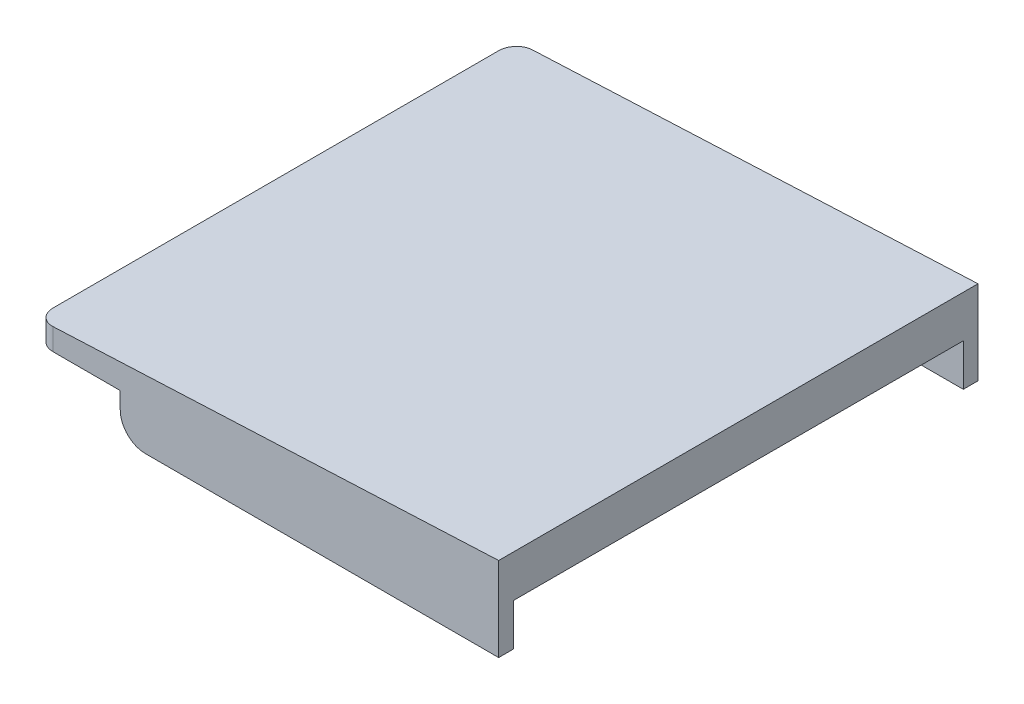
ISO-10303-21;
HEADER;
FILE_DESCRIPTION(('STEP AP214'),'2;1');
FILE_NAME('part.step','',(''),(''),'','','');
FILE_SCHEMA(('AUTOMOTIVE_DESIGN { 1 0 10303 214 1 1 1 1 }'));
ENDSEC;
DATA;
#1=APPLICATION_CONTEXT('core data for automotive mechanical design processes');
#2=APPLICATION_PROTOCOL_DEFINITION('international standard','automotive_design',2000,#1);
#3=PRODUCT_CONTEXT('',#1,'mechanical');
#4=PRODUCT('Part','Part','',(#3));
#5=PRODUCT_RELATED_PRODUCT_CATEGORY('part','',(#4));
#6=PRODUCT_DEFINITION_FORMATION('','',#4);
#7=PRODUCT_DEFINITION_CONTEXT('part definition',#1,'design');
#8=PRODUCT_DEFINITION('design','',#6,#7);
#9=PRODUCT_DEFINITION_SHAPE('','',#8);
#10=(LENGTH_UNIT() NAMED_UNIT(*) SI_UNIT(.MILLI.,.METRE.));
#11=(NAMED_UNIT(*) PLANE_ANGLE_UNIT() SI_UNIT($,.RADIAN.));
#12=(NAMED_UNIT(*) SI_UNIT($,.STERADIAN.) SOLID_ANGLE_UNIT());
#13=UNCERTAINTY_MEASURE_WITH_UNIT(LENGTH_MEASURE(1.E-05),#10,'distance_accuracy_value','');
#14=(GEOMETRIC_REPRESENTATION_CONTEXT(3) GLOBAL_UNCERTAINTY_ASSIGNED_CONTEXT((#13)) GLOBAL_UNIT_ASSIGNED_CONTEXT((#10,
#11,#12)) REPRESENTATION_CONTEXT('',''));
#15=CARTESIAN_POINT('',(0.,0.,0.));
#16=DIRECTION('',(0.,0.,1.));
#17=DIRECTION('',(1.,0.,0.));
#18=AXIS2_PLACEMENT_3D('',#15,#16,#17);
#19=CARTESIAN_POINT('',(0.,0.,57.));
#20=DIRECTION('',(0.,1.,0.));
#21=DIRECTION('',(0.,0.,1.));
#22=AXIS2_PLACEMENT_3D('',#19,#20,#21);
#23=PLANE('',#22);
#24=DIRECTION('',(1.,0.,0.));
#25=VECTOR('',#24,1.);
#26=CARTESIAN_POINT('',(0.,0.,2.));
#27=LINE('',#26,#25);
#28=CARTESIAN_POINT('',(2.,0.,2.));
#29=VERTEX_POINT('',#28);
#30=CARTESIAN_POINT('',(53.,0.,2.));
#31=VERTEX_POINT('',#30);
#32=EDGE_CURVE('E300',#29,#31,#27,.T.);
#33=ORIENTED_EDGE('',*,*,#32,.F.);
#34=DIRECTION('',(0.,0.,-1.));
#35=VECTOR('',#34,1.);
#36=CARTESIAN_POINT('',(2.,0.,57.));
#37=LINE('',#36,#35);
#38=CARTESIAN_POINT('',(2.,0.,55.));
#39=VERTEX_POINT('',#38);
#40=EDGE_CURVE('E216',#39,#29,#37,.T.);
#41=ORIENTED_EDGE('',*,*,#40,.F.);
#42=DIRECTION('',(1.,0.,0.));
#43=VECTOR('',#42,1.);
#44=CARTESIAN_POINT('',(0.,0.,55.));
#45=LINE('',#44,#43);
#46=CARTESIAN_POINT('',(53.,0.,55.));
#47=VERTEX_POINT('',#46);
#48=EDGE_CURVE('E221',#39,#47,#45,.T.);
#49=ORIENTED_EDGE('',*,*,#48,.T.);
#50=DIRECTION('',(0.,0.,-1.));
#51=VECTOR('',#50,1.);
#52=CARTESIAN_POINT('',(53.,0.,57.));
#53=LINE('',#52,#51);
#54=EDGE_CURVE('E321',#47,#31,#53,.T.);
#55=ORIENTED_EDGE('',*,*,#54,.T.);
#56=EDGE_LOOP('',(#33,#41,#49,#55));
#57=FACE_BOUND('',#56,.T.);
#58=DIRECTION('',(1.,0.,0.));
#59=VECTOR('',#58,1.);
#60=CARTESIAN_POINT('',(9.99999999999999,0.,55.25));
#61=LINE('',#60,#59);
#62=CARTESIAN_POINT('',(9.99999999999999,0.,55.25));
#63=VERTEX_POINT('',#62);
#64=CARTESIAN_POINT('',(55.,0.,55.25));
#65=VERTEX_POINT('',#64);
#66=EDGE_CURVE('E164',#63,#65,#61,.T.);
#67=ORIENTED_EDGE('',*,*,#66,.F.);
#68=DIRECTION('',(0.,0.,-1.));
#69=VECTOR('',#68,1.);
#70=CARTESIAN_POINT('',(9.99999999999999,0.,55.25));
#71=LINE('',#70,#69);
#72=CARTESIAN_POINT('',(9.99999999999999,0.,57.));
#73=VERTEX_POINT('',#72);
#74=EDGE_CURVE('E170',#73,#63,#71,.T.);
#75=ORIENTED_EDGE('',*,*,#74,.F.);
#76=DIRECTION('',(1.,0.,0.));
#77=VECTOR('',#76,1.);
#78=CARTESIAN_POINT('',(0.,0.,57.));
#79=LINE('',#78,#77);
#80=CARTESIAN_POINT('',(2.,0.,57.));
#81=VERTEX_POINT('',#80);
#82=EDGE_CURVE('E227',#81,#73,#79,.T.);
#83=ORIENTED_EDGE('',*,*,#82,.F.);
#84=CARTESIAN_POINT('',(2.,0.,55.));
#85=DIRECTION('',(0.,1.,0.));
#86=DIRECTION('',(0.,0.,1.));
#87=AXIS2_PLACEMENT_3D('',#84,#85,#86);
#88=CIRCLE('',#87,2.);
#89=CARTESIAN_POINT('',(0.,0.,55.));
#90=VERTEX_POINT('',#89);
#91=EDGE_CURVE('E198',#81,#90,#88,.F.);
#92=ORIENTED_EDGE('',*,*,#91,.T.);
#93=DIRECTION('',(0.,0.,-1.));
#94=VECTOR('',#93,1.);
#95=CARTESIAN_POINT('',(0.,0.,57.));
#96=LINE('',#95,#94);
#97=CARTESIAN_POINT('',(0.,0.,2.));
#98=VERTEX_POINT('',#97);
#99=EDGE_CURVE('E175',#90,#98,#96,.T.);
#100=ORIENTED_EDGE('',*,*,#99,.T.);
#101=CARTESIAN_POINT('',(2.,0.,2.));
#102=DIRECTION('',(0.,1.,0.));
#103=DIRECTION('',(0.,0.,1.));
#104=AXIS2_PLACEMENT_3D('',#101,#102,#103);
#105=CIRCLE('',#104,2.);
#106=CARTESIAN_POINT('',(2.,0.,0.));
#107=VERTEX_POINT('',#106);
#108=EDGE_CURVE('E200',#98,#107,#105,.F.);
#109=ORIENTED_EDGE('',*,*,#108,.T.);
#110=DIRECTION('',(1.,0.,0.));
#111=VECTOR('',#110,1.);
#112=CARTESIAN_POINT('',(0.,0.,0.));
#113=LINE('',#112,#111);
#114=CARTESIAN_POINT('',(10.,0.,0.));
#115=VERTEX_POINT('',#114);
#116=EDGE_CURVE('E211',#107,#115,#113,.T.);
#117=ORIENTED_EDGE('',*,*,#116,.T.);
#118=DIRECTION('',(0.,0.,-1.));
#119=VECTOR('',#118,1.);
#120=CARTESIAN_POINT('',(10.,0.,1.74999999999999));
#121=LINE('',#120,#119);
#122=CARTESIAN_POINT('',(10.,0.,1.74999999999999));
#123=VERTEX_POINT('',#122);
#124=EDGE_CURVE('E292',#123,#115,#121,.T.);
#125=ORIENTED_EDGE('',*,*,#124,.F.);
#126=DIRECTION('',(-1.,0.,0.));
#127=VECTOR('',#126,1.);
#128=CARTESIAN_POINT('',(55.,0.,1.75));
#129=LINE('',#128,#127);
#130=CARTESIAN_POINT('',(55.,0.,1.74999999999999));
#131=VERTEX_POINT('',#130);
#132=EDGE_CURVE('E160',#131,#123,#129,.T.);
#133=ORIENTED_EDGE('',*,*,#132,.F.);
#134=DIRECTION('',(0.,0.,-1.));
#135=VECTOR('',#134,1.);
#136=CARTESIAN_POINT('',(55.,0.,57.));
#137=LINE('',#136,#135);
#138=EDGE_CURVE('E156',#65,#131,#137,.T.);
#139=ORIENTED_EDGE('',*,*,#138,.F.);
#140=EDGE_LOOP('',(#67,#75,#83,#92,#100,#109,#117,#125,#133,#139));
#141=FACE_BOUND('',#140,.T.);
#142=ADVANCED_FACE('F28',(#57,#141),#23,.F.);
#143=CARTESIAN_POINT('',(0.,0.,57.));
#144=DIRECTION('',(1.,0.,0.));
#145=DIRECTION('',(0.,0.,-1.));
#146=AXIS2_PLACEMENT_3D('',#143,#144,#145);
#147=PLANE('',#146);
#148=DIRECTION('',(0.,0.,-1.));
#149=VECTOR('',#148,1.);
#150=CARTESIAN_POINT('',(0.,2.5,57.));
#151=LINE('',#150,#149);
#152=CARTESIAN_POINT('',(0.,2.5,55.));
#153=VERTEX_POINT('',#152);
#154=CARTESIAN_POINT('',(0.,2.5,2.));
#155=VERTEX_POINT('',#154);
#156=EDGE_CURVE('E182',#153,#155,#151,.T.);
#157=ORIENTED_EDGE('',*,*,#156,.T.);
#158=DIRECTION('',(0.,-1.,0.));
#159=VECTOR('',#158,1.);
#160=CARTESIAN_POINT('',(0.,0.,2.));
#161=LINE('',#160,#159);
#162=EDGE_CURVE('E195',#155,#98,#161,.T.);
#163=ORIENTED_EDGE('',*,*,#162,.T.);
#164=ORIENTED_EDGE('',*,*,#99,.F.);
#165=DIRECTION('',(0.,-1.,0.));
#166=VECTOR('',#165,1.);
#167=CARTESIAN_POINT('',(0.,0.,55.));
#168=LINE('',#167,#166);
#169=EDGE_CURVE('E179',#90,#153,#168,.F.);
#170=ORIENTED_EDGE('',*,*,#169,.T.);
#171=EDGE_LOOP('',(#157,#163,#164,#170));
#172=FACE_BOUND('',#171,.T.);
#173=ADVANCED_FACE('F30',(#172),#147,.F.);
#174=CARTESIAN_POINT('',(55.,0.,57.));
#175=DIRECTION('',(-1.,0.,0.));
#176=DIRECTION('',(0.,0.,1.));
#177=AXIS2_PLACEMENT_3D('',#174,#175,#176);
#178=PLANE('',#177);
#179=DIRECTION('',(0.,1.,0.));
#180=VECTOR('',#179,1.);
#181=CARTESIAN_POINT('',(55.,0.,0.));
#182=LINE('',#181,#180);
#183=CARTESIAN_POINT('',(55.,-5.,0.));
#184=VERTEX_POINT('',#183);
#185=CARTESIAN_POINT('',(55.,5.,0.));
#186=VERTEX_POINT('',#185);
#187=EDGE_CURVE('E215',#184,#186,#182,.T.);
#188=ORIENTED_EDGE('',*,*,#187,.T.);
#189=DIRECTION('',(0.,0.,-1.));
#190=VECTOR('',#189,1.);
#191=CARTESIAN_POINT('',(55.,5.,57.));
#192=LINE('',#191,#190);
#193=CARTESIAN_POINT('',(55.,5.,57.));
#194=VERTEX_POINT('',#193);
#195=EDGE_CURVE('E176',#194,#186,#192,.T.);
#196=ORIENTED_EDGE('',*,*,#195,.F.);
#197=DIRECTION('',(0.,1.,0.));
#198=VECTOR('',#197,1.);
#199=CARTESIAN_POINT('',(55.,0.,57.));
#200=LINE('',#199,#198);
#201=CARTESIAN_POINT('',(55.,-5.,57.));
#202=VERTEX_POINT('',#201);
#203=EDGE_CURVE('E230',#202,#194,#200,.T.);
#204=ORIENTED_EDGE('',*,*,#203,.F.);
#205=DIRECTION('',(0.,0.,1.));
#206=VECTOR('',#205,1.);
#207=CARTESIAN_POINT('',(55.,-5.,57.));
#208=LINE('',#207,#206);
#209=CARTESIAN_POINT('',(55.,-5.,55.25));
#210=VERTEX_POINT('',#209);
#211=EDGE_CURVE('E159',#210,#202,#208,.T.);
#212=ORIENTED_EDGE('',*,*,#211,.F.);
#213=DIRECTION('',(0.,1.,0.));
#214=VECTOR('',#213,1.);
#215=CARTESIAN_POINT('',(55.,-5.,55.25));
#216=LINE('',#215,#214);
#217=EDGE_CURVE('E151',#210,#65,#216,.T.);
#218=ORIENTED_EDGE('',*,*,#217,.T.);
#219=ORIENTED_EDGE('',*,*,#138,.T.);
#220=DIRECTION('',(0.,1.,0.));
#221=VECTOR('',#220,1.);
#222=CARTESIAN_POINT('',(55.,-5.,1.75));
#223=LINE('',#222,#221);
#224=CARTESIAN_POINT('',(55.,-5.,1.75));
#225=VERTEX_POINT('',#224);
#226=EDGE_CURVE('E259',#225,#131,#223,.T.);
#227=ORIENTED_EDGE('',*,*,#226,.F.);
#228=DIRECTION('',(0.,0.,1.));
#229=VECTOR('',#228,1.);
#230=CARTESIAN_POINT('',(55.,-5.,1.75));
#231=LINE('',#230,#229);
#232=EDGE_CURVE('E290',#184,#225,#231,.T.);
#233=ORIENTED_EDGE('',*,*,#232,.F.);
#234=EDGE_LOOP('',(#188,#196,#204,#212,#218,#219,#227,#233));
#235=FACE_BOUND('',#234,.T.);
#236=ADVANCED_FACE('F153',(#235),#178,.F.);
#237=CARTESIAN_POINT('',(0.,2.5,57.));
#238=DIRECTION('',(0.04540766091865,-0.9989685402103,0.));
#239=DIRECTION('',(0.9989685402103,0.04540766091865,0.));
#240=AXIS2_PLACEMENT_3D('',#237,#238,#239);
#241=PLANE('',#240);
#242=DIRECTION('',(-0.9989685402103,-0.04540766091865,0.));
#243=VECTOR('',#242,1.);
#244=CARTESIAN_POINT('',(0.,2.5,0.));
#245=LINE('',#244,#243);
#246=CARTESIAN_POINT('',(2.,2.59090909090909,0.));
#247=VERTEX_POINT('',#246);
#248=EDGE_CURVE('E224',#186,#247,#245,.T.);
#249=ORIENTED_EDGE('',*,*,#248,.T.);
#250=CARTESIAN_POINT('',(2.,2.59090909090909,2.));
#251=DIRECTION('',(0.04540766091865,-0.9989685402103,0.));
#252=DIRECTION('',(0.9989685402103,0.04540766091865,0.));
#253=AXIS2_PLACEMENT_3D('',#250,#251,#252);
#254=ELLIPSE('',#253,2.00206504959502,2.);
#255=EDGE_CURVE('E206',#247,#155,#254,.F.);
#256=ORIENTED_EDGE('',*,*,#255,.T.);
#257=ORIENTED_EDGE('',*,*,#156,.F.);
#258=CARTESIAN_POINT('',(2.,2.59090909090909,55.));
#259=DIRECTION('',(0.04540766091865,-0.9989685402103,0.));
#260=DIRECTION('',(-0.9989685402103,-0.04540766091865,0.));
#261=AXIS2_PLACEMENT_3D('',#258,#259,#260);
#262=ELLIPSE('',#261,2.00206504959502,2.);
#263=CARTESIAN_POINT('',(2.,2.59090909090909,57.));
#264=VERTEX_POINT('',#263);
#265=EDGE_CURVE('E204',#153,#264,#262,.F.);
#266=ORIENTED_EDGE('',*,*,#265,.T.);
#267=DIRECTION('',(-0.9989685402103,-0.04540766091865,0.));
#268=VECTOR('',#267,1.);
#269=CARTESIAN_POINT('',(0.,2.5,57.));
#270=LINE('',#269,#268);
#271=EDGE_CURVE('E232',#194,#264,#270,.T.);
#272=ORIENTED_EDGE('',*,*,#271,.F.);
#273=ORIENTED_EDGE('',*,*,#195,.T.);
#274=EDGE_LOOP('',(#249,#256,#257,#266,#272,#273));
#275=FACE_BOUND('',#274,.T.);
#276=ADVANCED_FACE('F362',(#275),#241,.F.);
#277=CARTESIAN_POINT('',(0.,0.,57.));
#278=DIRECTION('',(0.,0.,-1.));
#279=DIRECTION('',(-1.,0.,0.));
#280=AXIS2_PLACEMENT_3D('',#277,#278,#279);
#281=PLANE('',#280);
#282=DIRECTION('',(0.,1.,0.));
#283=VECTOR('',#282,1.);
#284=CARTESIAN_POINT('',(9.99999999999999,-5.,57.));
#285=LINE('',#284,#283);
#286=CARTESIAN_POINT('',(9.99999999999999,-2.,57.));
#287=VERTEX_POINT('',#286);
#288=EDGE_CURVE('E161',#287,#73,#285,.T.);
#289=ORIENTED_EDGE('',*,*,#288,.F.);
#290=CARTESIAN_POINT('',(13.,-2.,57.));
#291=DIRECTION('',(0.,0.,-1.));
#292=DIRECTION('',(-1.,0.,0.));
#293=AXIS2_PLACEMENT_3D('',#290,#291,#292);
#294=CIRCLE('',#293,3.);
#295=CARTESIAN_POINT('',(13.,-5.,57.));
#296=VERTEX_POINT('',#295);
#297=EDGE_CURVE('E11',#287,#296,#294,.F.);
#298=ORIENTED_EDGE('',*,*,#297,.T.);
#299=DIRECTION('',(-1.,0.,0.));
#300=VECTOR('',#299,1.);
#301=CARTESIAN_POINT('',(55.,-5.,57.));
#302=LINE('',#301,#300);
#303=EDGE_CURVE('E278',#202,#296,#302,.T.);
#304=ORIENTED_EDGE('',*,*,#303,.F.);
#305=ORIENTED_EDGE('',*,*,#203,.T.);
#306=ORIENTED_EDGE('',*,*,#271,.T.);
#307=DIRECTION('',(0.,-1.,0.));
#308=VECTOR('',#307,1.);
#309=CARTESIAN_POINT('',(2.,0.,57.));
#310=LINE('',#309,#308);
#311=EDGE_CURVE('E208',#264,#81,#310,.T.);
#312=ORIENTED_EDGE('',*,*,#311,.T.);
#313=ORIENTED_EDGE('',*,*,#82,.T.);
#314=EDGE_LOOP('',(#289,#298,#304,#305,#306,#312,#313));
#315=FACE_BOUND('',#314,.T.);
#316=ADVANCED_FACE('F351',(#315),#281,.F.);
#317=CARTESIAN_POINT('',(0.,0.,0.));
#318=DIRECTION('',(0.,0.,-1.));
#319=DIRECTION('',(-1.,0.,0.));
#320=AXIS2_PLACEMENT_3D('',#317,#318,#319);
#321=PLANE('',#320);
#322=DIRECTION('',(1.,0.,0.));
#323=VECTOR('',#322,1.);
#324=CARTESIAN_POINT('',(55.,-5.,0.));
#325=LINE('',#324,#323);
#326=CARTESIAN_POINT('',(13.,-5.,0.));
#327=VERTEX_POINT('',#326);
#328=EDGE_CURVE('E258',#327,#184,#325,.T.);
#329=ORIENTED_EDGE('',*,*,#328,.F.);
#330=CARTESIAN_POINT('',(13.,-2.,0.));
#331=DIRECTION('',(0.,0.,-1.));
#332=DIRECTION('',(-1.,0.,0.));
#333=AXIS2_PLACEMENT_3D('',#330,#331,#332);
#334=CIRCLE('',#333,3.);
#335=CARTESIAN_POINT('',(10.,-2.,0.));
#336=VERTEX_POINT('',#335);
#337=EDGE_CURVE('E254',#327,#336,#334,.T.);
#338=ORIENTED_EDGE('',*,*,#337,.T.);
#339=DIRECTION('',(0.,1.,0.));
#340=VECTOR('',#339,1.);
#341=CARTESIAN_POINT('',(10.,-5.,0.));
#342=LINE('',#341,#340);
#343=EDGE_CURVE('E253',#336,#115,#342,.T.);
#344=ORIENTED_EDGE('',*,*,#343,.T.);
#345=ORIENTED_EDGE('',*,*,#116,.F.);
#346=DIRECTION('',(0.,-1.,0.));
#347=VECTOR('',#346,1.);
#348=CARTESIAN_POINT('',(2.,2.5,0.));
#349=LINE('',#348,#347);
#350=EDGE_CURVE('E202',#107,#247,#349,.F.);
#351=ORIENTED_EDGE('',*,*,#350,.T.);
#352=ORIENTED_EDGE('',*,*,#248,.F.);
#353=ORIENTED_EDGE('',*,*,#187,.F.);
#354=EDGE_LOOP('',(#329,#338,#344,#345,#351,#352,#353));
#355=FACE_BOUND('',#354,.T.);
#356=ADVANCED_FACE('F250',(#355),#321,.T.);
#357=CARTESIAN_POINT('',(2.,0.,57.));
#358=DIRECTION('',(1.,0.,0.));
#359=DIRECTION('',(0.,0.,-1.));
#360=AXIS2_PLACEMENT_3D('',#357,#358,#359);
#361=PLANE('',#360);
#362=DIRECTION('',(0.,-1.,0.));
#363=VECTOR('',#362,1.);
#364=CARTESIAN_POINT('',(2.,0.,2.));
#365=LINE('',#364,#363);
#366=CARTESIAN_POINT('',(2.,0.58884404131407,2.));
#367=VERTEX_POINT('',#366);
#368=EDGE_CURVE('E296',#367,#29,#365,.T.);
#369=ORIENTED_EDGE('',*,*,#368,.F.);
#370=DIRECTION('',(0.,0.,-1.));
#371=VECTOR('',#370,1.);
#372=CARTESIAN_POINT('',(2.,0.58884404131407,57.));
#373=LINE('',#372,#371);
#374=CARTESIAN_POINT('',(2.,0.58884404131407,55.));
#375=VERTEX_POINT('',#374);
#376=EDGE_CURVE('E311',#375,#367,#373,.T.);
#377=ORIENTED_EDGE('',*,*,#376,.F.);
#378=DIRECTION('',(0.,-1.,0.));
#379=VECTOR('',#378,1.);
#380=CARTESIAN_POINT('',(2.,0.,55.));
#381=LINE('',#380,#379);
#382=EDGE_CURVE('E308',#375,#39,#381,.T.);
#383=ORIENTED_EDGE('',*,*,#382,.T.);
#384=ORIENTED_EDGE('',*,*,#40,.T.);
#385=EDGE_LOOP('',(#369,#377,#383,#384));
#386=FACE_BOUND('',#385,.T.);
#387=ADVANCED_FACE('F343',(#386),#361,.T.);
#388=CARTESIAN_POINT('',(53.,0.,57.));
#389=DIRECTION('',(-1.,0.,0.));
#390=DIRECTION('',(0.,0.,1.));
#391=AXIS2_PLACEMENT_3D('',#388,#389,#390);
#392=PLANE('',#391);
#393=DIRECTION('',(0.,1.,0.));
#394=VECTOR('',#393,1.);
#395=CARTESIAN_POINT('',(53.,0.,2.));
#396=LINE('',#395,#394);
#397=CARTESIAN_POINT('',(53.,2.90702585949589,2.));
#398=VERTEX_POINT('',#397);
#399=EDGE_CURVE('E305',#31,#398,#396,.T.);
#400=ORIENTED_EDGE('',*,*,#399,.F.);
#401=ORIENTED_EDGE('',*,*,#54,.F.);
#402=DIRECTION('',(0.,1.,0.));
#403=VECTOR('',#402,1.);
#404=CARTESIAN_POINT('',(53.,0.,55.));
#405=LINE('',#404,#403);
#406=CARTESIAN_POINT('',(53.,2.90702585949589,55.));
#407=VERTEX_POINT('',#406);
#408=EDGE_CURVE('E318',#47,#407,#405,.T.);
#409=ORIENTED_EDGE('',*,*,#408,.T.);
#410=DIRECTION('',(0.,0.,-1.));
#411=VECTOR('',#410,1.);
#412=CARTESIAN_POINT('',(53.,2.90702585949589,57.));
#413=LINE('',#412,#411);
#414=EDGE_CURVE('E314',#407,#398,#413,.T.);
#415=ORIENTED_EDGE('',*,*,#414,.T.);
#416=EDGE_LOOP('',(#400,#401,#409,#415));
#417=FACE_BOUND('',#416,.T.);
#418=ADVANCED_FACE('F332',(#417),#392,.T.);
#419=CARTESIAN_POINT('',(0.0908153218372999,0.502062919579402,57.));
#420=DIRECTION('',(0.04540766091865,-0.9989685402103,0.));
#421=DIRECTION('',(0.9989685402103,0.04540766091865,0.));
#422=AXIS2_PLACEMENT_3D('',#419,#420,#421);
#423=PLANE('',#422);
#424=DIRECTION('',(-0.9989685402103,-0.04540766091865,0.));
#425=VECTOR('',#424,1.);
#426=CARTESIAN_POINT('',(-0.0225867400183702,0.496908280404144,2.));
#427=LINE('',#426,#425);
#428=EDGE_CURVE('E310',#398,#367,#427,.T.);
#429=ORIENTED_EDGE('',*,*,#428,.F.);
#430=ORIENTED_EDGE('',*,*,#414,.F.);
#431=DIRECTION('',(-0.9989685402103,-0.04540766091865,0.));
#432=VECTOR('',#431,1.);
#433=CARTESIAN_POINT('',(-0.0225867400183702,0.496908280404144,55.));
#434=LINE('',#433,#432);
#435=EDGE_CURVE('E315',#407,#375,#434,.T.);
#436=ORIENTED_EDGE('',*,*,#435,.T.);
#437=ORIENTED_EDGE('',*,*,#376,.T.);
#438=EDGE_LOOP('',(#429,#430,#436,#437));
#439=FACE_BOUND('',#438,.T.);
#440=ADVANCED_FACE('F341',(#439),#423,.T.);
#441=CARTESIAN_POINT('',(0.,0.,55.));
#442=DIRECTION('',(0.,0.,-1.));
#443=DIRECTION('',(-1.,0.,0.));
#444=AXIS2_PLACEMENT_3D('',#441,#442,#443);
#445=PLANE('',#444);
#446=ORIENTED_EDGE('',*,*,#382,.F.);
#447=ORIENTED_EDGE('',*,*,#435,.F.);
#448=ORIENTED_EDGE('',*,*,#408,.F.);
#449=ORIENTED_EDGE('',*,*,#48,.F.);
#450=EDGE_LOOP('',(#446,#447,#448,#449));
#451=FACE_BOUND('',#450,.T.);
#452=ADVANCED_FACE('F337',(#451),#445,.T.);
#453=CARTESIAN_POINT('',(0.,0.,2.));
#454=DIRECTION('',(0.,0.,-1.));
#455=DIRECTION('',(-1.,0.,0.));
#456=AXIS2_PLACEMENT_3D('',#453,#454,#455);
#457=PLANE('',#456);
#458=ORIENTED_EDGE('',*,*,#368,.T.);
#459=ORIENTED_EDGE('',*,*,#32,.T.);
#460=ORIENTED_EDGE('',*,*,#399,.T.);
#461=ORIENTED_EDGE('',*,*,#428,.T.);
#462=EDGE_LOOP('',(#458,#459,#460,#461));
#463=FACE_BOUND('',#462,.T.);
#464=ADVANCED_FACE('F368',(#463),#457,.F.);
#465=CARTESIAN_POINT('',(2.,0.,2.));
#466=DIRECTION('',(0.,1.,0.));
#467=DIRECTION('',(0.,0.,1.));
#468=AXIS2_PLACEMENT_3D('',#465,#466,#467);
#469=CYLINDRICAL_SURFACE('',#468,2.);
#470=ORIENTED_EDGE('',*,*,#255,.F.);
#471=ORIENTED_EDGE('',*,*,#350,.F.);
#472=ORIENTED_EDGE('',*,*,#108,.F.);
#473=ORIENTED_EDGE('',*,*,#162,.F.);
#474=EDGE_LOOP('',(#470,#471,#472,#473));
#475=FACE_BOUND('',#474,.T.);
#476=ADVANCED_FACE('F244',(#475),#469,.T.);
#477=CARTESIAN_POINT('',(2.,0.,55.));
#478=DIRECTION('',(0.,-1.,0.));
#479=DIRECTION('',(0.,0.,-1.));
#480=AXIS2_PLACEMENT_3D('',#477,#478,#479);
#481=CYLINDRICAL_SURFACE('',#480,2.);
#482=ORIENTED_EDGE('',*,*,#265,.F.);
#483=ORIENTED_EDGE('',*,*,#169,.F.);
#484=ORIENTED_EDGE('',*,*,#91,.F.);
#485=ORIENTED_EDGE('',*,*,#311,.F.);
#486=EDGE_LOOP('',(#482,#483,#484,#485));
#487=FACE_BOUND('',#486,.T.);
#488=ADVANCED_FACE('F401',(#487),#481,.T.);
#489=CARTESIAN_POINT('',(55.,-5.,1.75));
#490=DIRECTION('',(0.,0.,-1.));
#491=DIRECTION('',(-1.,0.,0.));
#492=AXIS2_PLACEMENT_3D('',#489,#490,#491);
#493=PLANE('',#492);
#494=DIRECTION('',(0.,1.,0.));
#495=VECTOR('',#494,1.);
#496=CARTESIAN_POINT('',(10.,-5.,1.74999999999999));
#497=LINE('',#496,#495);
#498=CARTESIAN_POINT('',(10.,-2.,1.74999999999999));
#499=VERTEX_POINT('',#498);
#500=EDGE_CURVE('E257',#499,#123,#497,.T.);
#501=ORIENTED_EDGE('',*,*,#500,.F.);
#502=CARTESIAN_POINT('',(13.,-2.,1.75));
#503=DIRECTION('',(0.,0.,-1.));
#504=DIRECTION('',(-1.,0.,0.));
#505=AXIS2_PLACEMENT_3D('',#502,#503,#504);
#506=CIRCLE('',#505,3.);
#507=CARTESIAN_POINT('',(13.,-5.,1.75));
#508=VERTEX_POINT('',#507);
#509=EDGE_CURVE('E267',#499,#508,#506,.F.);
#510=ORIENTED_EDGE('',*,*,#509,.T.);
#511=DIRECTION('',(-1.,0.,0.));
#512=VECTOR('',#511,1.);
#513=CARTESIAN_POINT('',(55.,-5.,1.75));
#514=LINE('',#513,#512);
#515=EDGE_CURVE('E261',#225,#508,#514,.T.);
#516=ORIENTED_EDGE('',*,*,#515,.F.);
#517=ORIENTED_EDGE('',*,*,#226,.T.);
#518=ORIENTED_EDGE('',*,*,#132,.T.);
#519=EDGE_LOOP('',(#501,#510,#516,#517,#518));
#520=FACE_BOUND('',#519,.T.);
#521=ADVANCED_FACE('F406',(#520),#493,.F.);
#522=CARTESIAN_POINT('',(10.,-5.,1.74999999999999));
#523=DIRECTION('',(1.,0.,0.));
#524=DIRECTION('',(0.,0.,-1.));
#525=AXIS2_PLACEMENT_3D('',#522,#523,#524);
#526=PLANE('',#525);
#527=ORIENTED_EDGE('',*,*,#343,.F.);
#528=DIRECTION('',(0.,0.,-1.));
#529=VECTOR('',#528,1.);
#530=CARTESIAN_POINT('',(10.,-2.,1.74999999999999));
#531=LINE('',#530,#529);
#532=EDGE_CURVE('E265',#336,#499,#531,.F.);
#533=ORIENTED_EDGE('',*,*,#532,.T.);
#534=ORIENTED_EDGE('',*,*,#500,.T.);
#535=ORIENTED_EDGE('',*,*,#124,.T.);
#536=EDGE_LOOP('',(#527,#533,#534,#535));
#537=FACE_BOUND('',#536,.T.);
#538=ADVANCED_FACE('F440',(#537),#526,.F.);
#539=CARTESIAN_POINT('',(55.,-5.,1.75));
#540=DIRECTION('',(0.,1.,0.));
#541=DIRECTION('',(0.,0.,1.));
#542=AXIS2_PLACEMENT_3D('',#539,#540,#541);
#543=PLANE('',#542);
#544=ORIENTED_EDGE('',*,*,#515,.T.);
#545=DIRECTION('',(0.,0.,-1.));
#546=VECTOR('',#545,1.);
#547=CARTESIAN_POINT('',(13.,-5.,1.75));
#548=LINE('',#547,#546);
#549=EDGE_CURVE('E189',#508,#327,#548,.T.);
#550=ORIENTED_EDGE('',*,*,#549,.T.);
#551=ORIENTED_EDGE('',*,*,#328,.T.);
#552=ORIENTED_EDGE('',*,*,#232,.T.);
#553=EDGE_LOOP('',(#544,#550,#551,#552));
#554=FACE_BOUND('',#553,.T.);
#555=ADVANCED_FACE('F447',(#554),#543,.F.);
#556=CARTESIAN_POINT('',(9.99999999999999,-5.,55.25));
#557=DIRECTION('',(0.,0.,1.));
#558=DIRECTION('',(1.,0.,0.));
#559=AXIS2_PLACEMENT_3D('',#556,#557,#558);
#560=PLANE('',#559);
#561=DIRECTION('',(1.,0.,0.));
#562=VECTOR('',#561,1.);
#563=CARTESIAN_POINT('',(9.99999999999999,-5.,55.25));
#564=LINE('',#563,#562);
#565=CARTESIAN_POINT('',(13.,-5.,55.25));
#566=VERTEX_POINT('',#565);
#567=EDGE_CURVE('E276',#566,#210,#564,.T.);
#568=ORIENTED_EDGE('',*,*,#567,.F.);
#569=CARTESIAN_POINT('',(13.,-2.,55.25));
#570=DIRECTION('',(0.,0.,1.));
#571=DIRECTION('',(1.,0.,0.));
#572=AXIS2_PLACEMENT_3D('',#569,#570,#571);
#573=CIRCLE('',#572,3.);
#574=CARTESIAN_POINT('',(9.99999999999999,-2.,55.25));
#575=VERTEX_POINT('',#574);
#576=EDGE_CURVE('E50',#566,#575,#573,.F.);
#577=ORIENTED_EDGE('',*,*,#576,.T.);
#578=DIRECTION('',(0.,1.,0.));
#579=VECTOR('',#578,1.);
#580=CARTESIAN_POINT('',(9.99999999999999,-5.,55.25));
#581=LINE('',#580,#579);
#582=EDGE_CURVE('E166',#575,#63,#581,.T.);
#583=ORIENTED_EDGE('',*,*,#582,.T.);
#584=ORIENTED_EDGE('',*,*,#66,.T.);
#585=ORIENTED_EDGE('',*,*,#217,.F.);
#586=EDGE_LOOP('',(#568,#577,#583,#584,#585));
#587=FACE_BOUND('',#586,.T.);
#588=ADVANCED_FACE('F165',(#587),#560,.F.);
#589=CARTESIAN_POINT('',(9.99999999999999,-5.,55.25));
#590=DIRECTION('',(1.,0.,0.));
#591=DIRECTION('',(0.,0.,-1.));
#592=AXIS2_PLACEMENT_3D('',#589,#590,#591);
#593=PLANE('',#592);
#594=ORIENTED_EDGE('',*,*,#582,.F.);
#595=DIRECTION('',(0.,0.,-1.));
#596=VECTOR('',#595,1.);
#597=CARTESIAN_POINT('',(9.99999999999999,-2.,55.25));
#598=LINE('',#597,#596);
#599=EDGE_CURVE('E36',#575,#287,#598,.F.);
#600=ORIENTED_EDGE('',*,*,#599,.T.);
#601=ORIENTED_EDGE('',*,*,#288,.T.);
#602=ORIENTED_EDGE('',*,*,#74,.T.);
#603=EDGE_LOOP('',(#594,#600,#601,#602));
#604=FACE_BOUND('',#603,.T.);
#605=ADVANCED_FACE('F464',(#604),#593,.F.);
#606=CARTESIAN_POINT('',(55.,-5.,55.25));
#607=DIRECTION('',(0.,1.,0.));
#608=DIRECTION('',(0.,0.,1.));
#609=AXIS2_PLACEMENT_3D('',#606,#607,#608);
#610=PLANE('',#609);
#611=ORIENTED_EDGE('',*,*,#303,.T.);
#612=DIRECTION('',(0.,0.,-1.));
#613=VECTOR('',#612,1.);
#614=CARTESIAN_POINT('',(13.,-5.,55.25));
#615=LINE('',#614,#613);
#616=EDGE_CURVE('E269',#296,#566,#615,.T.);
#617=ORIENTED_EDGE('',*,*,#616,.T.);
#618=ORIENTED_EDGE('',*,*,#567,.T.);
#619=ORIENTED_EDGE('',*,*,#211,.T.);
#620=EDGE_LOOP('',(#611,#617,#618,#619));
#621=FACE_BOUND('',#620,.T.);
#622=ADVANCED_FACE('F275',(#621),#610,.F.);
#623=CARTESIAN_POINT('',(13.,-2.,1.75));
#624=DIRECTION('',(0.,0.,-1.));
#625=DIRECTION('',(-1.,0.,0.));
#626=AXIS2_PLACEMENT_3D('',#623,#624,#625);
#627=CYLINDRICAL_SURFACE('',#626,3.);
#628=ORIENTED_EDGE('',*,*,#509,.F.);
#629=ORIENTED_EDGE('',*,*,#532,.F.);
#630=ORIENTED_EDGE('',*,*,#337,.F.);
#631=ORIENTED_EDGE('',*,*,#549,.F.);
#632=EDGE_LOOP('',(#628,#629,#630,#631));
#633=FACE_BOUND('',#632,.T.);
#634=ADVANCED_FACE('F477',(#633),#627,.T.);
#635=CARTESIAN_POINT('',(13.,-2.,55.25));
#636=DIRECTION('',(0.,0.,-1.));
#637=DIRECTION('',(-1.,0.,0.));
#638=AXIS2_PLACEMENT_3D('',#635,#636,#637);
#639=CYLINDRICAL_SURFACE('',#638,3.);
#640=ORIENTED_EDGE('',*,*,#297,.F.);
#641=ORIENTED_EDGE('',*,*,#599,.F.);
#642=ORIENTED_EDGE('',*,*,#576,.F.);
#643=ORIENTED_EDGE('',*,*,#616,.F.);
#644=EDGE_LOOP('',(#640,#641,#642,#643));
#645=FACE_BOUND('',#644,.T.);
#646=ADVANCED_FACE('F487',(#645),#639,.T.);
#647=CLOSED_SHELL('',(#142,#173,#236,#276,#316,#356,#387,#418,#440,#452,#464,#476,#488,#521,
#538,#555,#588,#605,#622,#634,#646));
#648=MANIFOLD_SOLID_BREP('B2',#647);
#649=ADVANCED_BREP_SHAPE_REPRESENTATION('',(#18,#648),#14);
#650=SHAPE_DEFINITION_REPRESENTATION(#9,#649);
ENDSEC;
END-ISO-10303-21;
